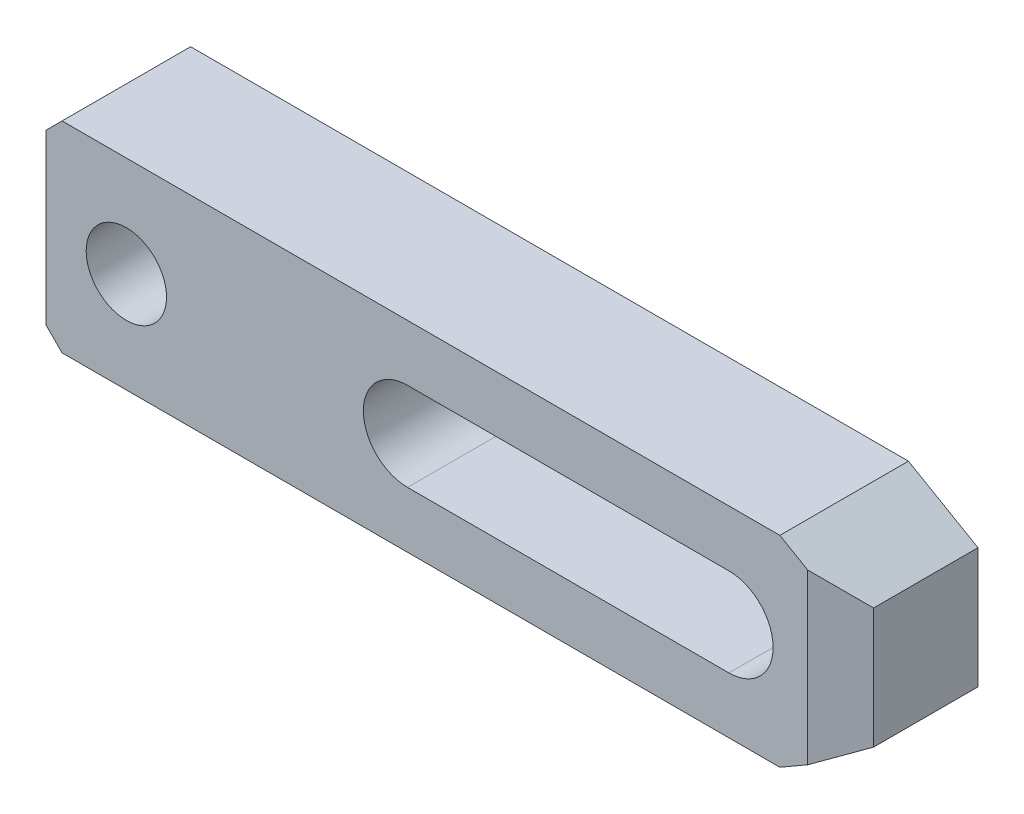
ISO-10303-21;
HEADER;
FILE_DESCRIPTION(('STEP AP214'),'2;1');
FILE_NAME('part.step','',(''),(''),'','','');
FILE_SCHEMA(('AUTOMOTIVE_DESIGN { 1 0 10303 214 1 1 1 1 }'));
ENDSEC;
DATA;
#1=APPLICATION_CONTEXT('core data for automotive mechanical design processes');
#2=APPLICATION_PROTOCOL_DEFINITION('international standard','automotive_design',2000,#1);
#3=PRODUCT_CONTEXT('',#1,'mechanical');
#4=PRODUCT('Part','Part','',(#3));
#5=PRODUCT_RELATED_PRODUCT_CATEGORY('part','',(#4));
#6=PRODUCT_DEFINITION_FORMATION('','',#4);
#7=PRODUCT_DEFINITION_CONTEXT('part definition',#1,'design');
#8=PRODUCT_DEFINITION('design','',#6,#7);
#9=PRODUCT_DEFINITION_SHAPE('','',#8);
#10=(LENGTH_UNIT() NAMED_UNIT(*) SI_UNIT(.MILLI.,.METRE.));
#11=(NAMED_UNIT(*) PLANE_ANGLE_UNIT() SI_UNIT($,.RADIAN.));
#12=(NAMED_UNIT(*) SI_UNIT($,.STERADIAN.) SOLID_ANGLE_UNIT());
#13=UNCERTAINTY_MEASURE_WITH_UNIT(LENGTH_MEASURE(1.E-05),#10,'distance_accuracy_value','');
#14=(GEOMETRIC_REPRESENTATION_CONTEXT(3) GLOBAL_UNCERTAINTY_ASSIGNED_CONTEXT((#13)) GLOBAL_UNIT_ASSIGNED_CONTEXT((#10,
#11,#12)) REPRESENTATION_CONTEXT('',''));
#15=CARTESIAN_POINT('',(0.,0.,0.));
#16=DIRECTION('',(0.,0.,1.));
#17=DIRECTION('',(1.,0.,0.));
#18=AXIS2_PLACEMENT_3D('',#15,#16,#17);
#19=CARTESIAN_POINT('',(-50.2993834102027,45.2006165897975,0.));
#20=DIRECTION('',(0.,0.,1.));
#21=DIRECTION('',(-1.,0.,0.));
#22=AXIS2_PLACEMENT_3D('',#19,#20,#21);
#23=PLANE('',#22);
#24=DIRECTION('',(0.,1.,0.));
#25=VECTOR('',#24,1.);
#26=CARTESIAN_POINT('',(-85.,-10.5,0.));
#27=LINE('',#26,#25);
#28=CARTESIAN_POINT('',(-85.,-10.5,0.));
#29=VERTEX_POINT('',#28);
#30=CARTESIAN_POINT('',(-85.,-5.5,0.));
#31=VERTEX_POINT('',#30);
#32=EDGE_CURVE('E147',#29,#31,#27,.T.);
#33=ORIENTED_EDGE('',*,*,#32,.T.);
#34=DIRECTION('',(-1.,0.,0.));
#35=VECTOR('',#34,1.);
#36=CARTESIAN_POINT('',(0.,-5.5,0.));
#37=LINE('',#36,#35);
#38=CARTESIAN_POINT('',(0.,-5.5,0.));
#39=VERTEX_POINT('',#38);
#40=EDGE_CURVE('E237',#39,#31,#37,.T.);
#41=ORIENTED_EDGE('',*,*,#40,.F.);
#42=CARTESIAN_POINT('',(0.,0.,0.));
#43=DIRECTION('',(0.,0.,1.));
#44=DIRECTION('',(-1.,0.,0.));
#45=AXIS2_PLACEMENT_3D('',#42,#43,#44);
#46=CIRCLE('',#45,5.5);
#47=CARTESIAN_POINT('',(0.,5.5,0.));
#48=VERTEX_POINT('',#47);
#49=EDGE_CURVE('E128',#39,#48,#46,.T.);
#50=ORIENTED_EDGE('',*,*,#49,.T.);
#51=DIRECTION('',(1.,0.,0.));
#52=VECTOR('',#51,1.);
#53=CARTESIAN_POINT('',(-40.,5.5,0.));
#54=LINE('',#53,#52);
#55=CARTESIAN_POINT('',(-85.,5.5,0.));
#56=VERTEX_POINT('',#55);
#57=EDGE_CURVE('E119',#56,#48,#54,.T.);
#58=ORIENTED_EDGE('',*,*,#57,.F.);
#59=CARTESIAN_POINT('',(-85.,10.5,0.));
#60=VERTEX_POINT('',#59);
#61=EDGE_CURVE('E124',#56,#60,#27,.T.);
#62=ORIENTED_EDGE('',*,*,#61,.T.);
#63=DIRECTION('',(-0.707106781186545,-0.70710678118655,0.));
#64=VECTOR('',#63,1.);
#65=CARTESIAN_POINT('',(-83.,12.5,0.));
#66=LINE('',#65,#64);
#67=CARTESIAN_POINT('',(-83.,12.5,0.));
#68=VERTEX_POINT('',#67);
#69=EDGE_CURVE('E148',#68,#60,#66,.T.);
#70=ORIENTED_EDGE('',*,*,#69,.F.);
#71=DIRECTION('',(-1.,0.,0.));
#72=VECTOR('',#71,1.);
#73=CARTESIAN_POINT('',(6.3397459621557,12.5,0.));
#74=LINE('',#73,#72);
#75=CARTESIAN_POINT('',(6.3397459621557,12.5,0.));
#76=VERTEX_POINT('',#75);
#77=EDGE_CURVE('E151',#76,#68,#74,.T.);
#78=ORIENTED_EDGE('',*,*,#77,.F.);
#79=DIRECTION('',(-0.866025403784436,0.5,0.));
#80=VECTOR('',#79,1.);
#81=CARTESIAN_POINT('',(15.,7.5,0.));
#82=LINE('',#81,#80);
#83=CARTESIAN_POINT('',(15.,7.5,0.));
#84=VERTEX_POINT('',#83);
#85=EDGE_CURVE('E158',#84,#76,#82,.T.);
#86=ORIENTED_EDGE('',*,*,#85,.F.);
#87=DIRECTION('',(0.,-1.,0.));
#88=VECTOR('',#87,1.);
#89=CARTESIAN_POINT('',(15.,7.5,0.));
#90=LINE('',#89,#88);
#91=CARTESIAN_POINT('',(15.,-7.5,0.));
#92=VERTEX_POINT('',#91);
#93=EDGE_CURVE('E181',#84,#92,#90,.T.);
#94=ORIENTED_EDGE('',*,*,#93,.T.);
#95=DIRECTION('',(-0.86602540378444,-0.5,0.));
#96=VECTOR('',#95,1.);
#97=CARTESIAN_POINT('',(15.,-7.5,0.));
#98=LINE('',#97,#96);
#99=CARTESIAN_POINT('',(6.33974596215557,-12.5,0.));
#100=VERTEX_POINT('',#99);
#101=EDGE_CURVE('E208',#92,#100,#98,.T.);
#102=ORIENTED_EDGE('',*,*,#101,.T.);
#103=DIRECTION('',(-1.,0.,0.));
#104=VECTOR('',#103,1.);
#105=CARTESIAN_POINT('',(6.33974596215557,-12.5,0.));
#106=LINE('',#105,#104);
#107=CARTESIAN_POINT('',(-83.,-12.5,0.));
#108=VERTEX_POINT('',#107);
#109=EDGE_CURVE('E210',#100,#108,#106,.T.);
#110=ORIENTED_EDGE('',*,*,#109,.T.);
#111=DIRECTION('',(-0.707106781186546,0.707106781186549,0.));
#112=VECTOR('',#111,1.);
#113=CARTESIAN_POINT('',(-83.,-12.5,0.));
#114=LINE('',#113,#112);
#115=EDGE_CURVE('E150',#108,#29,#114,.T.);
#116=ORIENTED_EDGE('',*,*,#115,.T.);
#117=EDGE_LOOP('',(#33,#41,#50,#58,#62,#70,#78,#86,#94,#102,#110,#116));
#118=FACE_BOUND('',#117,.T.);
#119=ADVANCED_FACE('F14',(#118),#23,.F.);
#120=CARTESIAN_POINT('',(-85.,-10.5,16.));
#121=DIRECTION('',(-1.,0.,0.));
#122=DIRECTION('',(0.,0.,-1.));
#123=AXIS2_PLACEMENT_3D('',#120,#121,#122);
#124=PLANE('',#123);
#125=DIRECTION('',(0.,-1.,0.));
#126=VECTOR('',#125,1.);
#127=CARTESIAN_POINT('',(-85.,-10.5,5.));
#128=LINE('',#127,#126);
#129=CARTESIAN_POINT('',(-85.,5.5,5.));
#130=VERTEX_POINT('',#129);
#131=CARTESIAN_POINT('',(-85.,-5.5,5.));
#132=VERTEX_POINT('',#131);
#133=EDGE_CURVE('E141',#130,#132,#128,.T.);
#134=ORIENTED_EDGE('',*,*,#133,.T.);
#135=DIRECTION('',(0.,0.,-1.));
#136=VECTOR('',#135,1.);
#137=CARTESIAN_POINT('',(-85.,-5.5,16.));
#138=LINE('',#137,#136);
#139=EDGE_CURVE('E140',#132,#31,#138,.T.);
#140=ORIENTED_EDGE('',*,*,#139,.T.);
#141=ORIENTED_EDGE('',*,*,#32,.F.);
#142=DIRECTION('',(0.,0.,-1.));
#143=VECTOR('',#142,1.);
#144=CARTESIAN_POINT('',(-85.,-10.5,16.));
#145=LINE('',#144,#143);
#146=CARTESIAN_POINT('',(-85.,-10.5,16.));
#147=VERTEX_POINT('',#146);
#148=EDGE_CURVE('E189',#147,#29,#145,.T.);
#149=ORIENTED_EDGE('',*,*,#148,.F.);
#150=DIRECTION('',(0.,1.,0.));
#151=VECTOR('',#150,1.);
#152=CARTESIAN_POINT('',(-85.,-10.5,16.));
#153=LINE('',#152,#151);
#154=CARTESIAN_POINT('',(-85.,10.5,16.));
#155=VERTEX_POINT('',#154);
#156=EDGE_CURVE('E171',#147,#155,#153,.T.);
#157=ORIENTED_EDGE('',*,*,#156,.T.);
#158=DIRECTION('',(0.,0.,-1.));
#159=VECTOR('',#158,1.);
#160=CARTESIAN_POINT('',(-85.,10.5,16.));
#161=LINE('',#160,#159);
#162=EDGE_CURVE('E145',#155,#60,#161,.T.);
#163=ORIENTED_EDGE('',*,*,#162,.T.);
#164=ORIENTED_EDGE('',*,*,#61,.F.);
#165=DIRECTION('',(0.,0.,-1.));
#166=VECTOR('',#165,1.);
#167=CARTESIAN_POINT('',(-85.,5.5,16.));
#168=LINE('',#167,#166);
#169=EDGE_CURVE('E135',#130,#56,#168,.T.);
#170=ORIENTED_EDGE('',*,*,#169,.F.);
#171=EDGE_LOOP('',(#134,#140,#141,#149,#157,#163,#164,#170));
#172=FACE_BOUND('',#171,.T.);
#173=ADVANCED_FACE('F143',(#172),#124,.T.);
#174=CARTESIAN_POINT('',(-75.,0.,16.));
#175=DIRECTION('',(0.,0.,-1.));
#176=DIRECTION('',(1.,0.,0.));
#177=AXIS2_PLACEMENT_3D('',#174,#175,#176);
#178=CYLINDRICAL_SURFACE('',#177,5.);
#179=CARTESIAN_POINT('',(-75.,0.,16.));
#180=DIRECTION('',(0.,0.,1.));
#181=DIRECTION('',(-1.,0.,0.));
#182=AXIS2_PLACEMENT_3D('',#179,#180,#181);
#183=CIRCLE('',#182,5.);
#184=CARTESIAN_POINT('',(-80.,0.,16.));
#185=VERTEX_POINT('',#184);
#186=EDGE_CURVE('E161',#185,#185,#183,.T.);
#187=ORIENTED_EDGE('',*,*,#186,.T.);
#188=EDGE_LOOP('',(#187));
#189=FACE_BOUND('',#188,.T.);
#190=CARTESIAN_POINT('',(-75.,0.,5.));
#191=DIRECTION('',(0.,0.,-1.));
#192=DIRECTION('',(1.,0.,0.));
#193=AXIS2_PLACEMENT_3D('',#190,#191,#192);
#194=CIRCLE('',#193,5.);
#195=CARTESIAN_POINT('',(-70.,0.,5.));
#196=VERTEX_POINT('',#195);
#197=EDGE_CURVE('E425',#196,#196,#194,.T.);
#198=ORIENTED_EDGE('',*,*,#197,.T.);
#199=EDGE_LOOP('',(#198));
#200=FACE_BOUND('',#199,.T.);
#201=ADVANCED_FACE('F262',(#189,#200),#178,.F.);
#202=CARTESIAN_POINT('',(-40.,0.,16.));
#203=DIRECTION('',(0.,0.,-1.));
#204=DIRECTION('',(1.,0.,0.));
#205=AXIS2_PLACEMENT_3D('',#202,#203,#204);
#206=CYLINDRICAL_SURFACE('',#205,5.5);
#207=DIRECTION('',(0.,0.,-1.));
#208=VECTOR('',#207,1.);
#209=CARTESIAN_POINT('',(-40.,-5.5,16.));
#210=LINE('',#209,#208);
#211=CARTESIAN_POINT('',(-40.,-5.5,16.));
#212=VERTEX_POINT('',#211);
#213=CARTESIAN_POINT('',(-40.,-5.5,5.));
#214=VERTEX_POINT('',#213);
#215=EDGE_CURVE('E256',#212,#214,#210,.T.);
#216=ORIENTED_EDGE('',*,*,#215,.T.);
#217=CARTESIAN_POINT('',(-40.,0.,5.));
#218=DIRECTION('',(0.,0.,-1.));
#219=DIRECTION('',(1.,0.,0.));
#220=AXIS2_PLACEMENT_3D('',#217,#218,#219);
#221=CIRCLE('',#220,5.5);
#222=CARTESIAN_POINT('',(-40.,5.5,5.));
#223=VERTEX_POINT('',#222);
#224=EDGE_CURVE('E278',#214,#223,#221,.T.);
#225=ORIENTED_EDGE('',*,*,#224,.T.);
#226=DIRECTION('',(0.,0.,-1.));
#227=VECTOR('',#226,1.);
#228=CARTESIAN_POINT('',(-40.,5.5,16.));
#229=LINE('',#228,#227);
#230=CARTESIAN_POINT('',(-40.,5.5,16.));
#231=VERTEX_POINT('',#230);
#232=EDGE_CURVE('E244',#231,#223,#229,.T.);
#233=ORIENTED_EDGE('',*,*,#232,.F.);
#234=CARTESIAN_POINT('',(-40.,0.,16.));
#235=DIRECTION('',(0.,0.,1.));
#236=DIRECTION('',(-1.,0.,0.));
#237=AXIS2_PLACEMENT_3D('',#234,#235,#236);
#238=CIRCLE('',#237,5.5);
#239=EDGE_CURVE('E132',#231,#212,#238,.T.);
#240=ORIENTED_EDGE('',*,*,#239,.T.);
#241=EDGE_LOOP('',(#216,#225,#233,#240));
#242=FACE_BOUND('',#241,.T.);
#243=ADVANCED_FACE('F269',(#242),#206,.F.);
#244=CARTESIAN_POINT('',(-50.2993834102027,45.2006165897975,16.));
#245=DIRECTION('',(0.,0.,1.));
#246=DIRECTION('',(-1.,0.,0.));
#247=AXIS2_PLACEMENT_3D('',#244,#245,#246);
#248=PLANE('',#247);
#249=DIRECTION('',(0.,-1.,0.));
#250=VECTOR('',#249,1.);
#251=CARTESIAN_POINT('',(9.80384757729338,45.2006165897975,16.));
#252=LINE('',#251,#250);
#253=CARTESIAN_POINT('',(9.80384757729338,10.5,16.));
#254=VERTEX_POINT('',#253);
#255=CARTESIAN_POINT('',(9.80384757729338,-10.5,16.));
#256=VERTEX_POINT('',#255);
#257=EDGE_CURVE('E233',#254,#256,#252,.T.);
#258=ORIENTED_EDGE('',*,*,#257,.F.);
#259=DIRECTION('',(-0.866025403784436,0.5,0.));
#260=VECTOR('',#259,1.);
#261=CARTESIAN_POINT('',(15.,7.5,16.));
#262=LINE('',#261,#260);
#263=CARTESIAN_POINT('',(6.3397459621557,12.5,16.));
#264=VERTEX_POINT('',#263);
#265=EDGE_CURVE('E179',#254,#264,#262,.T.);
#266=ORIENTED_EDGE('',*,*,#265,.T.);
#267=DIRECTION('',(-1.,0.,0.));
#268=VECTOR('',#267,1.);
#269=CARTESIAN_POINT('',(6.3397459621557,12.5,16.));
#270=LINE('',#269,#268);
#271=CARTESIAN_POINT('',(-83.,12.5,16.));
#272=VERTEX_POINT('',#271);
#273=EDGE_CURVE('E176',#264,#272,#270,.T.);
#274=ORIENTED_EDGE('',*,*,#273,.T.);
#275=DIRECTION('',(-0.707106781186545,-0.70710678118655,0.));
#276=VECTOR('',#275,1.);
#277=CARTESIAN_POINT('',(-83.,12.5,16.));
#278=LINE('',#277,#276);
#279=EDGE_CURVE('E173',#272,#155,#278,.T.);
#280=ORIENTED_EDGE('',*,*,#279,.T.);
#281=ORIENTED_EDGE('',*,*,#156,.F.);
#282=DIRECTION('',(-0.707106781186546,0.707106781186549,0.));
#283=VECTOR('',#282,1.);
#284=CARTESIAN_POINT('',(-83.,-12.5,16.));
#285=LINE('',#284,#283);
#286=CARTESIAN_POINT('',(-83.,-12.5,16.));
#287=VERTEX_POINT('',#286);
#288=EDGE_CURVE('E168',#287,#147,#285,.T.);
#289=ORIENTED_EDGE('',*,*,#288,.F.);
#290=DIRECTION('',(-1.,0.,0.));
#291=VECTOR('',#290,1.);
#292=CARTESIAN_POINT('',(6.33974596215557,-12.5,16.));
#293=LINE('',#292,#291);
#294=CARTESIAN_POINT('',(6.33974596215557,-12.5,16.));
#295=VERTEX_POINT('',#294);
#296=EDGE_CURVE('E165',#295,#287,#293,.T.);
#297=ORIENTED_EDGE('',*,*,#296,.F.);
#298=DIRECTION('',(-0.86602540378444,-0.5,0.));
#299=VECTOR('',#298,1.);
#300=CARTESIAN_POINT('',(15.,-7.5,16.));
#301=LINE('',#300,#299);
#302=EDGE_CURVE('E162',#256,#295,#301,.T.);
#303=ORIENTED_EDGE('',*,*,#302,.F.);
#304=EDGE_LOOP('',(#258,#266,#274,#280,#281,#289,#297,#303));
#305=FACE_BOUND('',#304,.T.);
#306=ORIENTED_EDGE('',*,*,#186,.F.);
#307=EDGE_LOOP('',(#306));
#308=FACE_BOUND('',#307,.T.);
#309=DIRECTION('',(-1.,0.,0.));
#310=VECTOR('',#309,1.);
#311=CARTESIAN_POINT('',(0.,-5.5,16.));
#312=LINE('',#311,#310);
#313=CARTESIAN_POINT('',(0.,-5.5,16.));
#314=VERTEX_POINT('',#313);
#315=EDGE_CURVE('E247',#314,#212,#312,.T.);
#316=ORIENTED_EDGE('',*,*,#315,.T.);
#317=ORIENTED_EDGE('',*,*,#239,.F.);
#318=DIRECTION('',(1.,0.,0.));
#319=VECTOR('',#318,1.);
#320=CARTESIAN_POINT('',(-40.,5.5,16.));
#321=LINE('',#320,#319);
#322=CARTESIAN_POINT('',(0.,5.5,16.));
#323=VERTEX_POINT('',#322);
#324=EDGE_CURVE('E241',#231,#323,#321,.T.);
#325=ORIENTED_EDGE('',*,*,#324,.T.);
#326=CARTESIAN_POINT('',(0.,0.,16.));
#327=DIRECTION('',(0.,0.,1.));
#328=DIRECTION('',(-1.,0.,0.));
#329=AXIS2_PLACEMENT_3D('',#326,#327,#328);
#330=CIRCLE('',#329,5.5);
#331=EDGE_CURVE('E245',#314,#323,#330,.T.);
#332=ORIENTED_EDGE('',*,*,#331,.F.);
#333=EDGE_LOOP('',(#316,#317,#325,#332));
#334=FACE_BOUND('',#333,.T.);
#335=ADVANCED_FACE('F265',(#305,#308,#334),#248,.T.);
#336=CARTESIAN_POINT('',(15.,7.5,16.));
#337=DIRECTION('',(-0.5,-0.866025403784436,0.));
#338=DIRECTION('',(0.866025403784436,-0.5,0.));
#339=AXIS2_PLACEMENT_3D('',#336,#337,#338);
#340=PLANE('',#339);
#341=ORIENTED_EDGE('',*,*,#265,.F.);
#342=DIRECTION('',(0.774596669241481,-0.447213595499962,-0.447213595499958));
#343=VECTOR('',#342,1.);
#344=CARTESIAN_POINT('',(13.9607695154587,8.1,13.6));
#345=LINE('',#344,#343);
#346=CARTESIAN_POINT('',(15.,7.5,13.));
#347=VERTEX_POINT('',#346);
#348=EDGE_CURVE('E235',#254,#347,#345,.T.);
#349=ORIENTED_EDGE('',*,*,#348,.T.);
#350=DIRECTION('',(0.,0.,-1.));
#351=VECTOR('',#350,1.);
#352=CARTESIAN_POINT('',(15.,7.5,16.));
#353=LINE('',#352,#351);
#354=EDGE_CURVE('E164',#347,#84,#353,.T.);
#355=ORIENTED_EDGE('',*,*,#354,.T.);
#356=ORIENTED_EDGE('',*,*,#85,.T.);
#357=DIRECTION('',(0.,0.,-1.));
#358=VECTOR('',#357,1.);
#359=CARTESIAN_POINT('',(6.3397459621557,12.5,16.));
#360=LINE('',#359,#358);
#361=EDGE_CURVE('E9',#264,#76,#360,.T.);
#362=ORIENTED_EDGE('',*,*,#361,.F.);
#363=EDGE_LOOP('',(#341,#349,#355,#356,#362));
#364=FACE_BOUND('',#363,.T.);
#365=ADVANCED_FACE('F268',(#364),#340,.F.);
#366=CARTESIAN_POINT('',(6.3397459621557,12.5,16.));
#367=DIRECTION('',(0.,-1.,0.));
#368=DIRECTION('',(0.,0.,1.));
#369=AXIS2_PLACEMENT_3D('',#366,#367,#368);
#370=PLANE('',#369);
#371=DIRECTION('',(0.,0.,-1.));
#372=VECTOR('',#371,1.);
#373=CARTESIAN_POINT('',(-83.,12.5,16.));
#374=LINE('',#373,#372);
#375=EDGE_CURVE('E22',#272,#68,#374,.T.);
#376=ORIENTED_EDGE('',*,*,#375,.F.);
#377=ORIENTED_EDGE('',*,*,#273,.F.);
#378=ORIENTED_EDGE('',*,*,#361,.T.);
#379=ORIENTED_EDGE('',*,*,#77,.T.);
#380=EDGE_LOOP('',(#376,#377,#378,#379));
#381=FACE_BOUND('',#380,.T.);
#382=ADVANCED_FACE('F16',(#381),#370,.F.);
#383=CARTESIAN_POINT('',(-83.,12.5,16.));
#384=DIRECTION('',(0.70710678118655,-0.707106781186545,0.));
#385=DIRECTION('',(0.707106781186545,0.70710678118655,0.));
#386=AXIS2_PLACEMENT_3D('',#383,#384,#385);
#387=PLANE('',#386);
#388=ORIENTED_EDGE('',*,*,#162,.F.);
#389=ORIENTED_EDGE('',*,*,#279,.F.);
#390=ORIENTED_EDGE('',*,*,#375,.T.);
#391=ORIENTED_EDGE('',*,*,#69,.T.);
#392=EDGE_LOOP('',(#388,#389,#390,#391));
#393=FACE_BOUND('',#392,.T.);
#394=ADVANCED_FACE('F193',(#393),#387,.F.);
#395=CARTESIAN_POINT('',(-83.,-12.5,16.));
#396=DIRECTION('',(-0.707106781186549,-0.707106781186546,0.));
#397=DIRECTION('',(0.707106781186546,-0.707106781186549,0.));
#398=AXIS2_PLACEMENT_3D('',#395,#396,#397);
#399=PLANE('',#398);
#400=DIRECTION('',(0.,0.,-1.));
#401=VECTOR('',#400,1.);
#402=CARTESIAN_POINT('',(-83.,-12.5,16.));
#403=LINE('',#402,#401);
#404=EDGE_CURVE('E187',#287,#108,#403,.T.);
#405=ORIENTED_EDGE('',*,*,#404,.F.);
#406=ORIENTED_EDGE('',*,*,#288,.T.);
#407=ORIENTED_EDGE('',*,*,#148,.T.);
#408=ORIENTED_EDGE('',*,*,#115,.F.);
#409=EDGE_LOOP('',(#405,#406,#407,#408));
#410=FACE_BOUND('',#409,.T.);
#411=ADVANCED_FACE('F220',(#410),#399,.T.);
#412=CARTESIAN_POINT('',(6.33974596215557,-12.5,16.));
#413=DIRECTION('',(0.,-1.,0.));
#414=DIRECTION('',(1.,0.,0.));
#415=AXIS2_PLACEMENT_3D('',#412,#413,#414);
#416=PLANE('',#415);
#417=DIRECTION('',(0.,0.,-1.));
#418=VECTOR('',#417,1.);
#419=CARTESIAN_POINT('',(6.33974596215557,-12.5,16.));
#420=LINE('',#419,#418);
#421=EDGE_CURVE('E185',#295,#100,#420,.T.);
#422=ORIENTED_EDGE('',*,*,#421,.F.);
#423=ORIENTED_EDGE('',*,*,#296,.T.);
#424=ORIENTED_EDGE('',*,*,#404,.T.);
#425=ORIENTED_EDGE('',*,*,#109,.F.);
#426=EDGE_LOOP('',(#422,#423,#424,#425));
#427=FACE_BOUND('',#426,.T.);
#428=ADVANCED_FACE('F306',(#427),#416,.T.);
#429=CARTESIAN_POINT('',(15.,-7.5,16.));
#430=DIRECTION('',(0.5,-0.86602540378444,0.));
#431=DIRECTION('',(0.86602540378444,0.5,0.));
#432=AXIS2_PLACEMENT_3D('',#429,#430,#431);
#433=PLANE('',#432);
#434=DIRECTION('',(0.774596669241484,0.447213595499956,-0.44721359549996));
#435=VECTOR('',#434,1.);
#436=CARTESIAN_POINT('',(13.9607695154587,-8.1,13.6));
#437=LINE('',#436,#435);
#438=CARTESIAN_POINT('',(15.,-7.5,13.));
#439=VERTEX_POINT('',#438);
#440=EDGE_CURVE('E37',#256,#439,#437,.T.);
#441=ORIENTED_EDGE('',*,*,#440,.F.);
#442=ORIENTED_EDGE('',*,*,#302,.T.);
#443=ORIENTED_EDGE('',*,*,#421,.T.);
#444=ORIENTED_EDGE('',*,*,#101,.F.);
#445=DIRECTION('',(0.,0.,-1.));
#446=VECTOR('',#445,1.);
#447=CARTESIAN_POINT('',(15.,-7.5,16.));
#448=LINE('',#447,#446);
#449=EDGE_CURVE('E183',#439,#92,#448,.T.);
#450=ORIENTED_EDGE('',*,*,#449,.F.);
#451=EDGE_LOOP('',(#441,#442,#443,#444,#450));
#452=FACE_BOUND('',#451,.T.);
#453=ADVANCED_FACE('F303',(#452),#433,.T.);
#454=CARTESIAN_POINT('',(15.,7.5,16.));
#455=DIRECTION('',(1.,0.,0.));
#456=DIRECTION('',(0.,0.,1.));
#457=AXIS2_PLACEMENT_3D('',#454,#455,#456);
#458=PLANE('',#457);
#459=DIRECTION('',(0.,-1.,0.));
#460=VECTOR('',#459,1.);
#461=CARTESIAN_POINT('',(15.,20.,13.));
#462=LINE('',#461,#460);
#463=EDGE_CURVE('E227',#347,#439,#462,.T.);
#464=ORIENTED_EDGE('',*,*,#463,.T.);
#465=ORIENTED_EDGE('',*,*,#449,.T.);
#466=ORIENTED_EDGE('',*,*,#93,.F.);
#467=ORIENTED_EDGE('',*,*,#354,.F.);
#468=EDGE_LOOP('',(#464,#465,#466,#467));
#469=FACE_BOUND('',#468,.T.);
#470=ADVANCED_FACE('F205',(#469),#458,.T.);
#471=CARTESIAN_POINT('',(0.,-5.5,16.));
#472=DIRECTION('',(0.,-1.,0.));
#473=DIRECTION('',(1.,0.,0.));
#474=AXIS2_PLACEMENT_3D('',#471,#472,#473);
#475=PLANE('',#474);
#476=ORIENTED_EDGE('',*,*,#40,.T.);
#477=ORIENTED_EDGE('',*,*,#139,.F.);
#478=DIRECTION('',(1.,0.,0.));
#479=VECTOR('',#478,1.);
#480=CARTESIAN_POINT('',(-95.,-5.5,5.));
#481=LINE('',#480,#479);
#482=EDGE_CURVE('E276',#132,#214,#481,.T.);
#483=ORIENTED_EDGE('',*,*,#482,.T.);
#484=ORIENTED_EDGE('',*,*,#215,.F.);
#485=ORIENTED_EDGE('',*,*,#315,.F.);
#486=DIRECTION('',(0.,0.,-1.));
#487=VECTOR('',#486,1.);
#488=CARTESIAN_POINT('',(0.,-5.5,16.));
#489=LINE('',#488,#487);
#490=EDGE_CURVE('E255',#314,#39,#489,.T.);
#491=ORIENTED_EDGE('',*,*,#490,.T.);
#492=EDGE_LOOP('',(#476,#477,#483,#484,#485,#491));
#493=FACE_BOUND('',#492,.T.);
#494=ADVANCED_FACE('F275',(#493),#475,.F.);
#495=CARTESIAN_POINT('',(0.,0.,16.));
#496=DIRECTION('',(0.,0.,-1.));
#497=DIRECTION('',(1.,0.,0.));
#498=AXIS2_PLACEMENT_3D('',#495,#496,#497);
#499=CYLINDRICAL_SURFACE('',#498,5.5);
#500=DIRECTION('',(0.,0.,-1.));
#501=VECTOR('',#500,1.);
#502=CARTESIAN_POINT('',(0.,5.5,16.));
#503=LINE('',#502,#501);
#504=EDGE_CURVE('E253',#323,#48,#503,.T.);
#505=ORIENTED_EDGE('',*,*,#504,.T.);
#506=ORIENTED_EDGE('',*,*,#49,.F.);
#507=ORIENTED_EDGE('',*,*,#490,.F.);
#508=ORIENTED_EDGE('',*,*,#331,.T.);
#509=EDGE_LOOP('',(#505,#506,#507,#508));
#510=FACE_BOUND('',#509,.T.);
#511=ADVANCED_FACE('F280',(#510),#499,.F.);
#512=CARTESIAN_POINT('',(-40.,5.5,16.));
#513=DIRECTION('',(0.,1.,0.));
#514=DIRECTION('',(-1.,0.,0.));
#515=AXIS2_PLACEMENT_3D('',#512,#513,#514);
#516=PLANE('',#515);
#517=ORIENTED_EDGE('',*,*,#57,.T.);
#518=ORIENTED_EDGE('',*,*,#504,.F.);
#519=ORIENTED_EDGE('',*,*,#324,.F.);
#520=ORIENTED_EDGE('',*,*,#232,.T.);
#521=DIRECTION('',(1.,0.,0.));
#522=VECTOR('',#521,1.);
#523=CARTESIAN_POINT('',(-95.,5.5,5.));
#524=LINE('',#523,#522);
#525=EDGE_CURVE('E29',#130,#223,#524,.T.);
#526=ORIENTED_EDGE('',*,*,#525,.F.);
#527=ORIENTED_EDGE('',*,*,#169,.T.);
#528=EDGE_LOOP('',(#517,#518,#519,#520,#526,#527));
#529=FACE_BOUND('',#528,.T.);
#530=ADVANCED_FACE('F136',(#529),#516,.F.);
#531=CARTESIAN_POINT('',(2.87564434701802,20.,20.));
#532=DIRECTION('',(-0.5,0.,-0.866025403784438));
#533=DIRECTION('',(0.866025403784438,0.,-0.5));
#534=AXIS2_PLACEMENT_3D('',#531,#532,#533);
#535=PLANE('',#534);
#536=ORIENTED_EDGE('',*,*,#257,.T.);
#537=ORIENTED_EDGE('',*,*,#440,.T.);
#538=ORIENTED_EDGE('',*,*,#463,.F.);
#539=ORIENTED_EDGE('',*,*,#348,.F.);
#540=EDGE_LOOP('',(#536,#537,#538,#539));
#541=FACE_BOUND('',#540,.T.);
#542=ADVANCED_FACE('F288',(#541),#535,.F.);
#543=CARTESIAN_POINT('',(-95.,-5.5,5.));
#544=DIRECTION('',(0.,0.,-1.));
#545=DIRECTION('',(1.,0.,0.));
#546=AXIS2_PLACEMENT_3D('',#543,#544,#545);
#547=PLANE('',#546);
#548=ORIENTED_EDGE('',*,*,#197,.F.);
#549=EDGE_LOOP('',(#548));
#550=FACE_BOUND('',#549,.T.);
#551=ORIENTED_EDGE('',*,*,#525,.T.);
#552=ORIENTED_EDGE('',*,*,#224,.F.);
#553=ORIENTED_EDGE('',*,*,#482,.F.);
#554=ORIENTED_EDGE('',*,*,#133,.F.);
#555=EDGE_LOOP('',(#551,#552,#553,#554));
#556=FACE_BOUND('',#555,.T.);
#557=ADVANCED_FACE('F410',(#550,#556),#547,.T.);
#558=CLOSED_SHELL('',(#119,#173,#201,#243,#335,#365,#382,#394,#411,#428,#453,#470,#494,#511,
#530,#542,#557));
#559=MANIFOLD_SOLID_BREP('B1',#558);
#560=ADVANCED_BREP_SHAPE_REPRESENTATION('',(#18,#559),#14);
#561=SHAPE_DEFINITION_REPRESENTATION(#9,#560);
ENDSEC;
END-ISO-10303-21;
